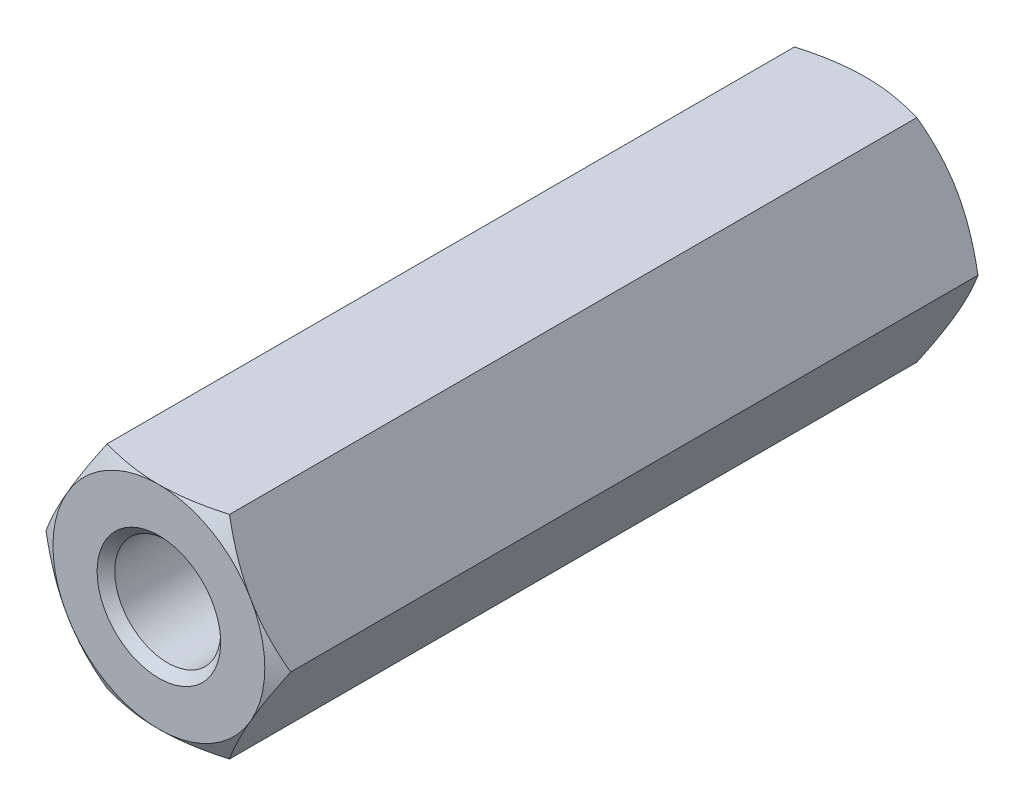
from build123d import *

# Parameters (mm, degrees)
BOSS_EXTRUDE1_DEPTH      = 10
SKETCH2_OUTSIDE_W        = 53.21
SKETCH2_OUTSIDE_H        = 52.282
SKETCH2_OUTSIDE_R        = 3
CUT_EXTRUDE1_DEPTH       = 12
CUT_EXTRUDE1_DRAFT       = -60
SKETCH3_R                = 1.5
SKETCH3_R_2              = 1.25
CUT_EXTRUDE2_DEPTH       = 10
SKETCH3_2_R              = 1.25
CUT_EXTRUDE3_DEPTH       = 10.75
CHAMFER1_SIZE            = 0.25
MIRROR1_COPY_1_SKETCH_W  = 53.21
MIRROR1_COPY_1_SKETCH_H  = 52.282
MIRROR1_COPY_1_SKETCH_R  = 3
MIRROR1_COPY_1_DEPTH     = 12
MIRROR1_COPY_1_DRAFT     = -60
CHAMFER1_OF_MIRROR1_SIZE = 0.25


with BuildPart() as part:
    # Sketch1 → Boss-Extrude1 (new body)
    with BuildSketch(Plane.XY):
        Polygon((1.732050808, 3), (-1.732050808, 3), (-3.464101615, 0), (-1.732050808, -3), (1.732050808, -3), (3.464101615, 0), align=None)
    boss_extrude1 = extrude(amount=-BOSS_EXTRUDE1_DEPTH)


with BuildPart() as cut_extrude1_tool:
    # Sketch2 outside → Cut-Extrude1 (with draft: the straight prism first)
    with BuildSketch(Plane(origin=(0, 0, -10), x_dir=(-1, 0, 0), z_dir=(0, 0, -1))):
        Rectangle(SKETCH2_OUTSIDE_W, SKETCH2_OUTSIDE_H)
        Circle(SKETCH2_OUTSIDE_R, mode=Mode.SUBTRACT)
    extrude(amount=-CUT_EXTRUDE1_DEPTH)
    # Cut-Extrude1: the draft: its side faces are tilted about the plane it starts from
    cut_extrude1_sides = [cut_extrude1_tool.faces().sort_by_distance(p)[0] for p in [
        (0, -26.141, -4),
        (-26.605, 0, -4),
        (0, 26.141, -4),
        (26.605, 0, -4),
        (3, 0, -4),
    ]]
    draft(cut_extrude1_sides, Plane(origin=(0, 0, -10), x_dir=(-1, 0, 0), z_dir=(0, 0, -1)), CUT_EXTRUDE1_DRAFT)


with BuildPart() as part_1:
    add(part.part)

    # Cut-Extrude1: cut by cut_extrude1_tool
    add(cut_extrude1_tool.part, mode=Mode.SUBTRACT)

    # Sketch3 → Cut-Extrude2 (cut)
    with BuildSketch(Plane(origin=(0, 0, -10), x_dir=(-1, 0, 0), z_dir=(0, 0, -1))):
        Circle(SKETCH3_R)
        Circle(SKETCH3_R_2, mode=Mode.SUBTRACT)
    cut_extrude2 = extrude(amount=-CUT_EXTRUDE2_DEPTH, mode=Mode.SUBTRACT)


with BuildPart() as cut_extrude2_piece_1:
    # of the separate pieces the step leaves, piece 1, a body of its own (cut_extrude2_pieces)
    add(part_1.part.solids().sort_by_distance((1.732050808, 3, 0))[0])

    # Chamfer1
    chamfer1_edges = [cut_extrude2_piece_1.edges().sort_by_distance(p)[0] for p in [
        (1.5, 0, -10),
    ]]
    chamfer(chamfer1_edges, length=CHAMFER1_SIZE)


with BuildPart() as cut_extrude2_piece_2:
    # of the separate pieces the step leaves, piece 2, a body of its own (cut_extrude2_pieces)
    add(part_1.part.solids().sort_by_distance((-1.25, 0, 0))[0])

    # Sketch3_2 → Cut-Extrude3 (cut)
    with BuildSketch(Plane(origin=(0, 0, -10), x_dir=(-1, 0, 0), z_dir=(0, 0, -1))):
        Circle(SKETCH3_2_R)
    cut_extrude3 = extrude(amount=-CUT_EXTRUDE3_DEPTH, mode=Mode.SUBTRACT)


with BuildPart() as cut_extrude2_piece_1_1:
    add(cut_extrude2_piece_1.part)

    # Mirror1: Boss-Extrude1, Cut-Extrude2, Cut-Extrude3 across plane
    add(boss_extrude1.mirror(Plane.XY))
    add(cut_extrude2.mirror(Plane.XY), mode=Mode.SUBTRACT)
    add(cut_extrude3.mirror(Plane.XY), mode=Mode.SUBTRACT)


with BuildPart() as mirror1_copy_1_tool:
    # Mirror1 copy 1 sketch → Mirror1 copy 1 (with draft: the straight prism first)
    with BuildSketch(Plane(origin=(0, 0, 10), x_dir=(-1, 0, 0), z_dir=(0, 0, 1))):
        Rectangle(MIRROR1_COPY_1_SKETCH_W, MIRROR1_COPY_1_SKETCH_H)
        Circle(MIRROR1_COPY_1_SKETCH_R, mode=Mode.SUBTRACT)
    extrude(amount=-MIRROR1_COPY_1_DEPTH)
    # Mirror1 copy 1: the draft: its side faces are tilted about the plane it starts from
    mirror1_copy_1_sides = [mirror1_copy_1_tool.faces().sort_by_distance(p)[0] for p in [
        (0, -26.141, 4),
        (-26.605, 0, 4),
        (0, 26.141, 4),
        (26.605, 0, 4),
        (3, 0, 4),
    ]]
    draft(mirror1_copy_1_sides, Plane(origin=(0, 0, 10), x_dir=(-1, 0, 0), z_dir=(0, 0, 1)), MIRROR1_COPY_1_DRAFT)


with BuildPart() as cut_extrude2_piece_1_2:
    add(cut_extrude2_piece_1_1.part)

    # Mirror1 copy 1: cut by mirror1_copy_1_tool
    add(mirror1_copy_1_tool.part, mode=Mode.SUBTRACT)

    # Chamfer1 of Mirror1
    chamfer1_of_mirror1_edges = [cut_extrude2_piece_1_2.edges().sort_by_distance(p)[0] for p in [
        (1.5, 0, 10),
    ]]
    chamfer(chamfer1_of_mirror1_edges, length=CHAMFER1_OF_MIRROR1_SIZE)


solid = cut_extrude2_piece_1_2.part
